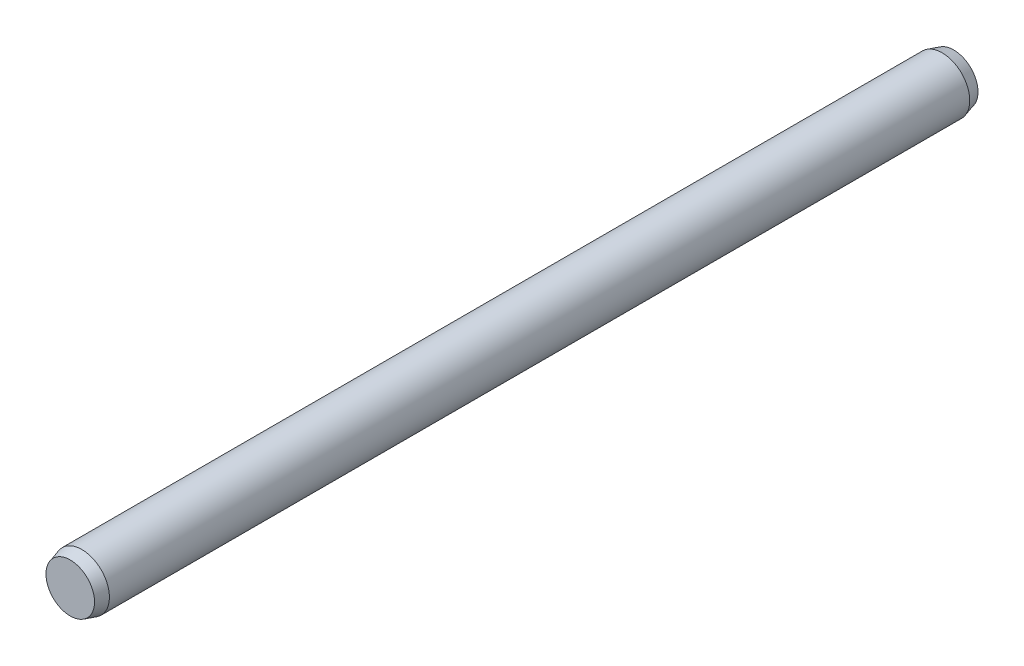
from build123d import *


with BuildPart() as part:
    # Sketch3 → Revolve1 (revolve)
    with BuildSketch(Plane(origin=(0, 0, 0), x_dir=(0, 0, -1), z_dir=(1, 0, 0)), mode=Mode.PRIVATE) as revolve1_sk:
        Polygon((-25.4, 0), (25.4, 0), (25.4, 1.397), (24.735647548, 1.5875), (-24.735647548, 1.5875), (-25.4, 1.397), align=None)
    revolve(revolve1_sk.sketch.rotate(Axis((0, 0, 25.4), (0, 0, -1)), 90), axis=Axis((0, 0, 25.4), (0, 0, -1)))


solid = part.part
